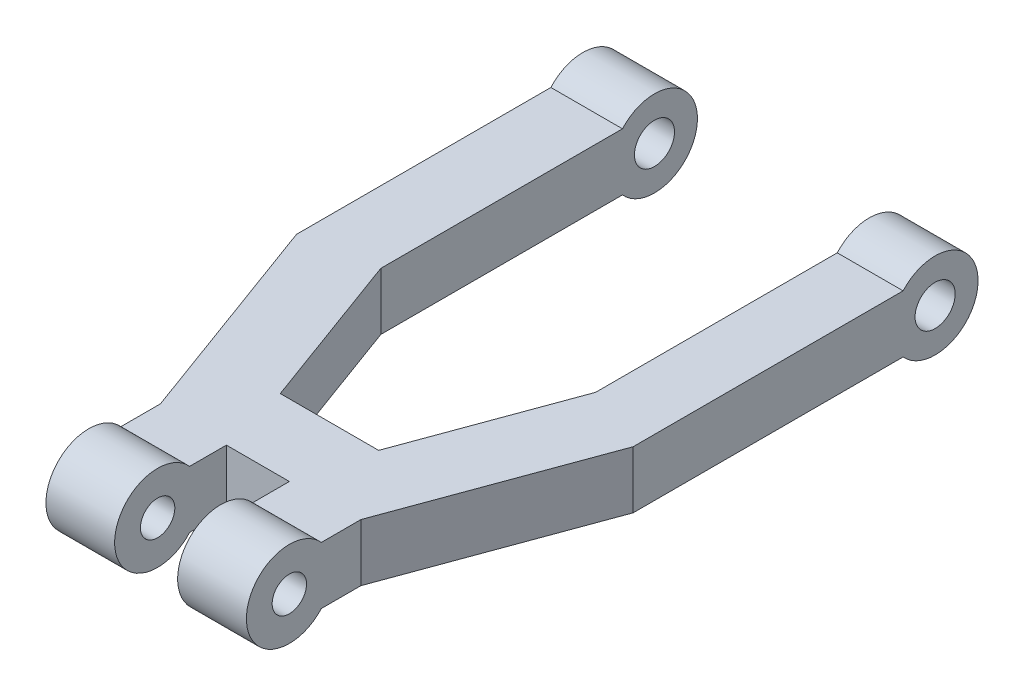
from build123d import *

# Parameters (mm, degrees)
SKETCH1_W               = 50.8
SKETCH1_H               = 5.08
BOSS_EXTRUDE1_DEPTH     = 31.242
SKETCH2_R               = 3.81
BOSS_EXTRUDE2_DEPTH     = 31.242
CUT_EXTRUDE1_DEPTH      = 64.234778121
CUT_EXTRUDE1_DEPTH_BACK = 64.234778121
SKETCH3_W               = 5.588
SKETCH3_H               = 13.661235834
SKETCH4_R               = 1.778
SKETCH4_R_2             = 1.524
CUT_EXTRUDE2_DEPTH      = 64.234778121


with BuildPart() as part:
    # Sketch1 → Boss-Extrude1 (new body)
    with BuildSketch(Plane(origin=(0, 0, 0), x_dir=(0, 0, -1), z_dir=(1, 0, 0))):
        with Locations((25.4, 2.54)):
            Rectangle(SKETCH1_W, SKETCH1_H)
    extrude(amount=BOSS_EXTRUDE1_DEPTH)

    # Sketch2 → Boss-Extrude2 (add)
    with BuildSketch(Plane(origin=(31.242, 0, 0), x_dir=(0, 0, -1), z_dir=(1, 0, 0))):
        with Locations((0, 2.54)):
            Circle(SKETCH2_R)
        with Locations((50.8, 2.54)):
            Circle(SKETCH2_R)
    extrude(amount=-BOSS_EXTRUDE2_DEPTH)

    # Sketch3 → Cut-Extrude1 (cut, two sides: drawn at the far end of the back side and taken through both)
    with BuildSketch(Plane(origin=(0, 5.08, 0), x_dir=(1, 0, 0), z_dir=(0, 1, 0)).offset(-CUT_EXTRUDE1_DEPTH_BACK)):
        Polygon((0, 25.4), (6.985, 6.35), (6.985, -6.172591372), (-2.607349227, -6.172591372), (-2.607349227, 25.4), align=None)
        Polygon((6.35, 57.910070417), (6.35, 26.527465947), (11.511944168, 12.449436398), (20.238055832, 12.449436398), (25.4, 26.527465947), (25.4, 57.910070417), align=None)
        Polygon((34.357349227, -6.172591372), (34.357349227, 25.4), (31.75, 25.4), (24.765, 6.35), (24.765, -6.172591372), align=None)
        with Locations((15.875, -0.731181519)):
            Rectangle(SKETCH3_W, SKETCH3_H)
    extrude(amount=CUT_EXTRUDE1_DEPTH + CUT_EXTRUDE1_DEPTH_BACK, mode=Mode.SUBTRACT)

    # Sketch4 → Cut-Extrude2 (cut, through all)
    with BuildSketch(Plane.ZY):
        with Locations((-50.8, 2.54)):
            Circle(SKETCH4_R)
        with Locations((0, 2.54)):
            Circle(SKETCH4_R_2)
    extrude(amount=-CUT_EXTRUDE2_DEPTH, mode=Mode.SUBTRACT)


solid = part.part
